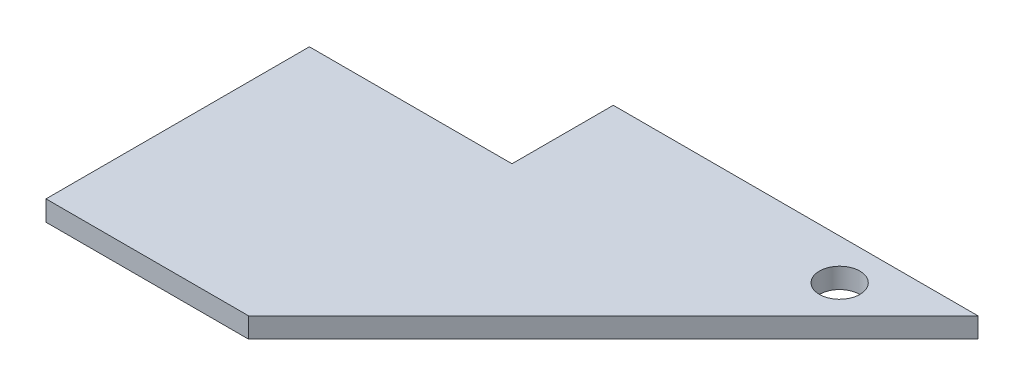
from build123d import *

# Parameters (mm, degrees)
EXTRUDE1_DEPTH     = 5
SKETCH2_R          = 5
CUT_EXTRUDE1_DEPTH = 167.508258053


with BuildPart() as part:
    # Sketch1 → Extrude1 (new body)
    with BuildSketch(Plane(origin=(0, 0, 0), x_dir=(1, 0, 0), z_dir=(0, 1, 0))):
        Polygon((0, 0), (50, 0), (140, 90), (50, 90), (50, 65), (0, 65), align=None)
    extrude(amount=EXTRUDE1_DEPTH)

    # Sketch2 → Cut-Extrude1 (cut, through all)
    with BuildSketch(Plane(origin=(0, 5, 0), x_dir=(-1, 0, 0), z_dir=(0, 1, 0))):
        with Locations(Location((-115.857864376, -80, 0), (0, 0, 90))):
            Circle(SKETCH2_R)
    extrude(amount=-CUT_EXTRUDE1_DEPTH, mode=Mode.SUBTRACT)


solid = part.part
